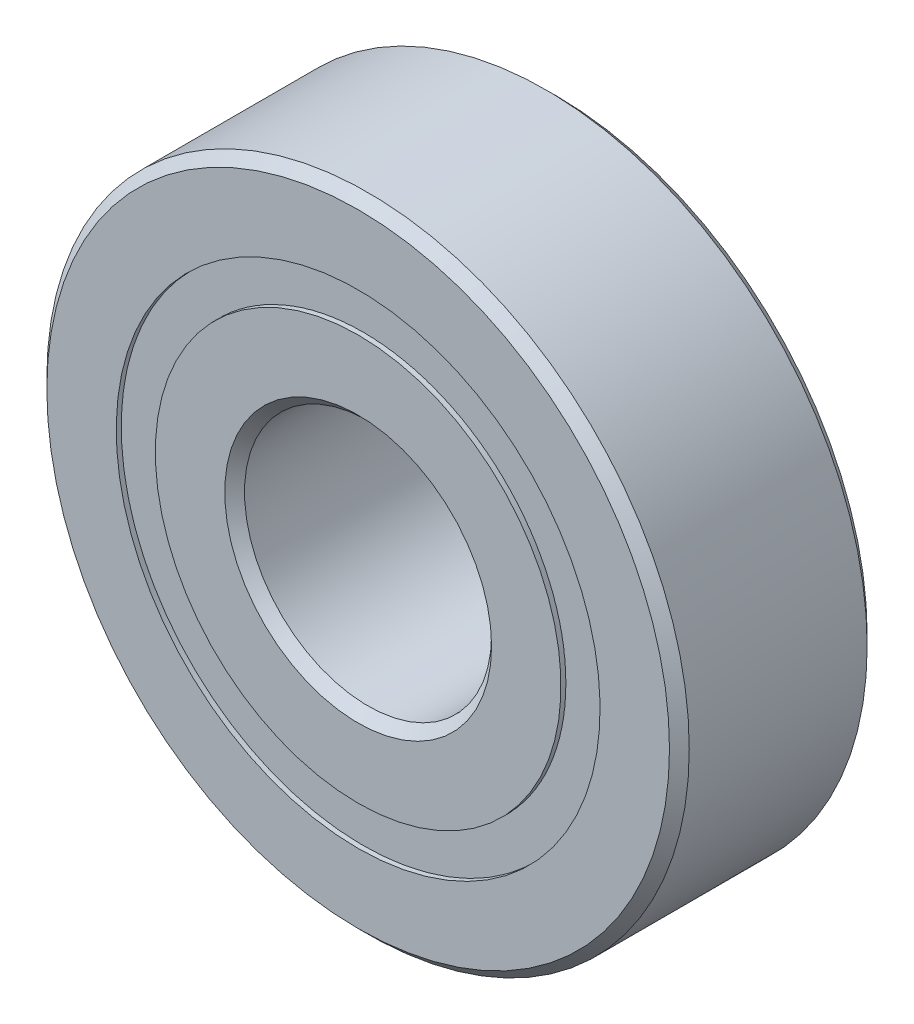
ISO-10303-21;
HEADER;
FILE_DESCRIPTION(('STEP AP214'),'2;1');
FILE_NAME('part.step','',(''),(''),'','','');
FILE_SCHEMA(('AUTOMOTIVE_DESIGN { 1 0 10303 214 1 1 1 1 }'));
ENDSEC;
DATA;
#1=APPLICATION_CONTEXT('core data for automotive mechanical design processes');
#2=APPLICATION_PROTOCOL_DEFINITION('international standard','automotive_design',2000,#1);
#3=PRODUCT_CONTEXT('',#1,'mechanical');
#4=PRODUCT('Part','Part','',(#3));
#5=PRODUCT_RELATED_PRODUCT_CATEGORY('part','',(#4));
#6=PRODUCT_DEFINITION_FORMATION('','',#4);
#7=PRODUCT_DEFINITION_CONTEXT('part definition',#1,'design');
#8=PRODUCT_DEFINITION('design','',#6,#7);
#9=PRODUCT_DEFINITION_SHAPE('','',#8);
#10=(LENGTH_UNIT() NAMED_UNIT(*) SI_UNIT(.MILLI.,.METRE.));
#11=(NAMED_UNIT(*) PLANE_ANGLE_UNIT() SI_UNIT($,.RADIAN.));
#12=(NAMED_UNIT(*) SI_UNIT($,.STERADIAN.) SOLID_ANGLE_UNIT());
#13=UNCERTAINTY_MEASURE_WITH_UNIT(LENGTH_MEASURE(1.E-05),#10,'distance_accuracy_value','');
#14=(GEOMETRIC_REPRESENTATION_CONTEXT(3) GLOBAL_UNCERTAINTY_ASSIGNED_CONTEXT((#13)) GLOBAL_UNIT_ASSIGNED_CONTEXT((#10,
#11,#12)) REPRESENTATION_CONTEXT('',''));
#15=CARTESIAN_POINT('',(0.,0.,0.));
#16=DIRECTION('',(0.,0.,1.));
#17=DIRECTION('',(1.,0.,0.));
#18=AXIS2_PLACEMENT_3D('',#15,#16,#17);
#19=CARTESIAN_POINT('',(0.,9.,0.));
#20=DIRECTION('',(0.,0.,1.));
#21=DIRECTION('',(0.,-1.,0.));
#22=AXIS2_PLACEMENT_3D('',#19,#20,#21);
#23=SPHERICAL_SURFACE('',#22,1.945894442);
#24=CARTESIAN_POINT('',(0.,9.,-1.945894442));
#25=VERTEX_POINT('',#24);
#26=VERTEX_LOOP('',#25);
#27=FACE_BOUND('',#26,.T.);
#28=CARTESIAN_POINT('',(0.,9.,1.945894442));
#29=VERTEX_POINT('',#28);
#30=VERTEX_LOOP('',#29);
#31=FACE_BOUND('',#30,.T.);
#32=ADVANCED_FACE('P0_F16',(#27,#31),#23,.T.);
#33=CLOSED_SHELL('',(#32));
#34=MANIFOLD_SOLID_BREP('P0_B1',#33);
#35=CARTESIAN_POINT('',(0.,0.,-3.6));
#36=DIRECTION('',(0.,0.,1.));
#37=DIRECTION('',(1.,0.,0.));
#38=AXIS2_PLACEMENT_3D('',#35,#36,#37);
#39=CYLINDRICAL_SURFACE('',#38,5.);
#40=CARTESIAN_POINT('',(0.,0.,-3.60000000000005));
#41=DIRECTION('',(0.,0.,-1.));
#42=DIRECTION('',(-1.,0.,0.));
#43=AXIS2_PLACEMENT_3D('',#40,#41,#42);
#44=CIRCLE('',#43,5.);
#45=CARTESIAN_POINT('',(-5.,0.,-3.6));
#46=VERTEX_POINT('',#45);
#47=EDGE_CURVE('P1_E95',#46,#46,#44,.F.);
#48=ORIENTED_EDGE('',*,*,#47,.F.);
#49=EDGE_LOOP('',(#48));
#50=FACE_BOUND('',#49,.T.);
#51=CARTESIAN_POINT('',(0.,0.,3.60000000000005));
#52=DIRECTION('',(0.,0.,1.));
#53=DIRECTION('',(1.,0.,0.));
#54=AXIS2_PLACEMENT_3D('',#51,#52,#53);
#55=CIRCLE('',#54,5.);
#56=CARTESIAN_POINT('',(5.,0.,3.6));
#57=VERTEX_POINT('',#56);
#58=EDGE_CURVE('P1_E89',#57,#57,#55,.F.);
#59=ORIENTED_EDGE('',*,*,#58,.F.);
#60=EDGE_LOOP('',(#59));
#61=FACE_BOUND('',#60,.T.);
#62=ADVANCED_FACE('P1_F17',(#50,#61),#39,.F.);
#63=CARTESIAN_POINT('',(0.,0.,-3.6));
#64=DIRECTION('',(0.,0.,-1.));
#65=DIRECTION('',(-1.,0.,0.));
#66=AXIS2_PLACEMENT_3D('',#63,#64,#65);
#67=CONICAL_SURFACE('',#66,5.,0.785398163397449);
#68=CARTESIAN_POINT('',(0.,0.,-4.));
#69=DIRECTION('',(0.,0.,-1.));
#70=DIRECTION('',(-1.,0.,0.));
#71=AXIS2_PLACEMENT_3D('',#68,#69,#70);
#72=CIRCLE('',#71,5.4);
#73=CARTESIAN_POINT('',(-5.4,0.,-4.));
#74=VERTEX_POINT('',#73);
#75=EDGE_CURVE('P1_E21',#74,#74,#72,.T.);
#76=ORIENTED_EDGE('',*,*,#75,.T.);
#77=EDGE_LOOP('',(#76));
#78=FACE_BOUND('',#77,.T.);
#79=ORIENTED_EDGE('',*,*,#47,.T.);
#80=EDGE_LOOP('',(#79));
#81=FACE_BOUND('',#80,.T.);
#82=ADVANCED_FACE('P1_F108',(#78,#81),#67,.F.);
#83=CARTESIAN_POINT('',(0.,0.,3.6));
#84=DIRECTION('',(0.,0.,1.));
#85=DIRECTION('',(1.,0.,0.));
#86=AXIS2_PLACEMENT_3D('',#83,#84,#85);
#87=CONICAL_SURFACE('',#86,5.,0.785398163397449);
#88=ORIENTED_EDGE('',*,*,#58,.T.);
#89=EDGE_LOOP('',(#88));
#90=FACE_BOUND('',#89,.T.);
#91=CARTESIAN_POINT('',(0.,0.,4.));
#92=DIRECTION('',(0.,0.,1.));
#93=DIRECTION('',(1.,0.,0.));
#94=AXIS2_PLACEMENT_3D('',#91,#92,#93);
#95=CIRCLE('',#94,5.4);
#96=CARTESIAN_POINT('',(5.4,0.,4.));
#97=VERTEX_POINT('',#96);
#98=EDGE_CURVE('P1_E101',#97,#97,#95,.T.);
#99=ORIENTED_EDGE('',*,*,#98,.T.);
#100=EDGE_LOOP('',(#99));
#101=FACE_BOUND('',#100,.T.);
#102=ADVANCED_FACE('P1_F114',(#90,#101),#87,.F.);
#103=CARTESIAN_POINT('',(-8.307296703,-8.307296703,-4.));
#104=DIRECTION('',(0.,0.,1.));
#105=DIRECTION('',(1.,0.,0.));
#106=AXIS2_PLACEMENT_3D('',#103,#104,#105);
#107=PLANE('',#106);
#108=ORIENTED_EDGE('',*,*,#75,.F.);
#109=EDGE_LOOP('',(#108));
#110=FACE_BOUND('',#109,.T.);
#111=CARTESIAN_POINT('',(0.,0.,-4.));
#112=DIRECTION('',(0.,0.,1.));
#113=DIRECTION('',(1.,0.,0.));
#114=AXIS2_PLACEMENT_3D('',#111,#112,#113);
#115=CIRCLE('',#114,8.208791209);
#116=CARTESIAN_POINT('',(8.208791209,0.,-4.));
#117=VERTEX_POINT('',#116);
#118=EDGE_CURVE('P1_E60',#117,#117,#115,.F.);
#119=ORIENTED_EDGE('',*,*,#118,.T.);
#120=EDGE_LOOP('',(#119));
#121=FACE_BOUND('',#120,.T.);
#122=ADVANCED_FACE('P1_F111',(#110,#121),#107,.F.);
#123=CARTESIAN_POINT('',(8.307296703,-8.307296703,4.));
#124=DIRECTION('',(0.,0.,-1.));
#125=DIRECTION('',(-1.,0.,0.));
#126=AXIS2_PLACEMENT_3D('',#123,#124,#125);
#127=PLANE('',#126);
#128=ORIENTED_EDGE('',*,*,#98,.F.);
#129=EDGE_LOOP('',(#128));
#130=FACE_BOUND('',#129,.T.);
#131=CARTESIAN_POINT('',(0.,0.,4.));
#132=DIRECTION('',(0.,0.,1.));
#133=DIRECTION('',(0.,-1.,0.));
#134=AXIS2_PLACEMENT_3D('',#131,#132,#133);
#135=CIRCLE('',#134,8.208791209);
#136=CARTESIAN_POINT('',(0.,-8.208791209,4.));
#137=VERTEX_POINT('',#136);
#138=EDGE_CURVE('P1_E59',#137,#137,#135,.T.);
#139=ORIENTED_EDGE('',*,*,#138,.T.);
#140=EDGE_LOOP('',(#139));
#141=FACE_BOUND('',#140,.T.);
#142=ADVANCED_FACE('P1_F19',(#130,#141),#127,.F.);
#143=CARTESIAN_POINT('',(0.,0.,-4.));
#144=DIRECTION('',(0.,0.,1.));
#145=DIRECTION('',(1.,0.,0.));
#146=AXIS2_PLACEMENT_3D('',#143,#144,#145);
#147=CYLINDRICAL_SURFACE('',#146,8.208791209);
#148=CARTESIAN_POINT('',(0.,0.,-1.7777777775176));
#149=DIRECTION('',(0.,0.,-1.));
#150=DIRECTION('',(0.,1.,0.));
#151=AXIS2_PLACEMENT_3D('',#148,#149,#150);
#152=CIRCLE('',#151,8.20879120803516);
#153=CARTESIAN_POINT('',(-8.208791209,-3.36730244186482E-09,-1.7777777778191));
#154=VERTEX_POINT('',#153);
#155=CARTESIAN_POINT('',(8.20879120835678,-4.91398098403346E-10,-1.7777777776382));
#156=VERTEX_POINT('',#155);
#157=EDGE_CURVE('P1_E65',#154,#156,#152,.T.);
#158=ORIENTED_EDGE('',*,*,#157,.T.);
#159=CARTESIAN_POINT('',(0.,0.,-1.7777777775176));
#160=DIRECTION('',(0.,0.,-1.));
#161=DIRECTION('',(0.,1.,0.));
#162=AXIS2_PLACEMENT_3D('',#159,#160,#161);
#163=CIRCLE('',#162,8.20879120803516);
#164=EDGE_CURVE('P1_E50',#156,#154,#163,.T.);
#165=ORIENTED_EDGE('',*,*,#164,.T.);
#166=EDGE_LOOP('',(#158,#165));
#167=FACE_BOUND('',#166,.T.);
#168=ORIENTED_EDGE('',*,*,#118,.F.);
#169=EDGE_LOOP('',(#168));
#170=FACE_BOUND('',#169,.T.);
#171=ADVANCED_FACE('P1_F69',(#167,#170),#147,.T.);
#172=CARTESIAN_POINT('',(-8.390225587,0.,-1.847885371));
#173=CARTESIAN_POINT('',(-8.390225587,-16.780451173,-1.847885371));
#174=CARTESIAN_POINT('',(8.390225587,-16.780451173,-1.847885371));
#175=CARTESIAN_POINT('',(8.390225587,0.,-1.847885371));
#176=CARTESIAN_POINT('',(-7.486968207,0.,-1.549824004));
#177=CARTESIAN_POINT('',(-7.486968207,-14.973936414,-1.549824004));
#178=CARTESIAN_POINT('',(7.486968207,-14.973936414,-1.549824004));
#179=CARTESIAN_POINT('',(7.486968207,0.,-1.549824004));
#180=CARTESIAN_POINT('',(-6.968868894,0.,-0.752147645));
#181=CARTESIAN_POINT('',(-6.968868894,-13.937737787,-0.752147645));
#182=CARTESIAN_POINT('',(6.968868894,-13.937737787,-0.752147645));
#183=CARTESIAN_POINT('',(6.968868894,0.,-0.752147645));
#184=CARTESIAN_POINT('',(-7.063826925,0.,0.194265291));
#185=CARTESIAN_POINT('',(-7.063826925,-14.127653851,0.194265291));
#186=CARTESIAN_POINT('',(7.063826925,-14.127653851,0.194265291));
#187=CARTESIAN_POINT('',(7.063826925,0.,0.194265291));
#188=(BOUNDED_SURFACE() B_SPLINE_SURFACE(3,3,((#172,#173,#174,#175),(#176,#177,#178,#179),(#180,
#181,#182,#183),(#184,#185,#186,#187)),.UNSPECIFIED.,.F.,.F.,
.F.) B_SPLINE_SURFACE_WITH_KNOTS((4,4),(4,4),(0.,1.),(0.,1.),
.UNSPECIFIED.) GEOMETRIC_REPRESENTATION_ITEM() RATIONAL_B_SPLINE_SURFACE(((1.,0.333333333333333,
0.333333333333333,1.),(0.853374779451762,0.284458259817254,0.284458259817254,0.853374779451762),
(0.853374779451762,0.284458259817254,0.284458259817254,0.853374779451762),(1.,0.333333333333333,
0.333333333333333,1.))) REPRESENTATION_ITEM('') SURFACE());
#189=CARTESIAN_POINT('',(-8.390225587,0.,-1.847885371));
#190=CARTESIAN_POINT('',(-7.486968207,0.,-1.549824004));
#191=CARTESIAN_POINT('',(-6.968868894,0.,-0.752147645));
#192=CARTESIAN_POINT('',(-7.063826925,0.,0.194265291));
#193=(BOUNDED_CURVE() B_SPLINE_CURVE(3,(#189,#190,#191,#192),.UNSPECIFIED.,.F.,
.F.) B_SPLINE_CURVE_WITH_KNOTS((4,4),(0.,1.),
.UNSPECIFIED.) CURVE() GEOMETRIC_REPRESENTATION_ITEM() RATIONAL_B_SPLINE_CURVE((1.,
0.853374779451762,0.853374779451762,1.)) REPRESENTATION_ITEM(''));
#194=CARTESIAN_POINT('',(-7.05410555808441,0.,-1.774671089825E-10));
#195=VERTEX_POINT('',#194);
#196=EDGE_CURVE('P1_E58',#195,#154,#193,.F.);
#197=CARTESIAN_POINT('',(8.390225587,0.,-1.847885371));
#198=CARTESIAN_POINT('',(7.486968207,0.,-1.549824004));
#199=CARTESIAN_POINT('',(6.968868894,0.,-0.752147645));
#200=CARTESIAN_POINT('',(7.063826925,0.,0.194265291));
#201=(BOUNDED_CURVE() B_SPLINE_CURVE(3,(#197,#198,#199,#200),.UNSPECIFIED.,.F.,
.F.) B_SPLINE_CURVE_WITH_KNOTS((4,4),(0.,1.),
.UNSPECIFIED.) CURVE() GEOMETRIC_REPRESENTATION_ITEM() RATIONAL_B_SPLINE_CURVE((1.,
0.853374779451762,0.853374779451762,1.)) REPRESENTATION_ITEM(''));
#202=CARTESIAN_POINT('',(7.05410555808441,0.,-3.54934244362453E-10));
#203=VERTEX_POINT('',#202);
#204=EDGE_CURVE('P1_E56',#156,#203,#201,.T.);
#205=CARTESIAN_POINT('',(0.,0.,7.09868569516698E-10));
#206=DIRECTION('',(0.,0.,-1.));
#207=DIRECTION('',(0.,1.,0.));
#208=AXIS2_PLACEMENT_3D('',#205,#206,#207);
#209=CIRCLE('',#208,7.05410555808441);
#210=EDGE_CURVE('P1_E35',#203,#195,#209,.T.);
#211=ORIENTED_EDGE('',*,*,#196,.T.);
#212=ORIENTED_EDGE('',*,*,#164,.F.);
#213=ORIENTED_EDGE('',*,*,#204,.T.);
#214=ORIENTED_EDGE('',*,*,#210,.T.);
#215=EDGE_LOOP('',(#211,#212,#213,#214));
#216=FACE_BOUND('',#215,.T.);
#217=ADVANCED_FACE('P1_F55',(#216),#188,.F.);
#218=CARTESIAN_POINT('',(0.,0.,1.777777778));
#219=DIRECTION('',(0.,0.,1.));
#220=DIRECTION('',(0.,-1.,0.));
#221=AXIS2_PLACEMENT_3D('',#218,#219,#220);
#222=CYLINDRICAL_SURFACE('',#221,8.208791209);
#223=ORIENTED_EDGE('',*,*,#138,.F.);
#224=EDGE_LOOP('',(#223));
#225=FACE_BOUND('',#224,.T.);
#226=CARTESIAN_POINT('',(0.,0.,1.7777777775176));
#227=DIRECTION('',(0.,0.,1.));
#228=DIRECTION('',(0.,-1.,0.));
#229=AXIS2_PLACEMENT_3D('',#226,#227,#228);
#230=CIRCLE('',#229,8.20879120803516);
#231=CARTESIAN_POINT('',(8.208791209,0.,1.7777777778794));
#232=VERTEX_POINT('',#231);
#233=CARTESIAN_POINT('',(-8.20879120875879,-2.52547683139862E-09,1.7777777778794));
#234=VERTEX_POINT('',#233);
#235=EDGE_CURVE('P1_E175',#232,#234,#230,.T.);
#236=ORIENTED_EDGE('',*,*,#235,.T.);
#237=CARTESIAN_POINT('',(0.,0.,1.7777777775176));
#238=DIRECTION('',(0.,0.,1.));
#239=DIRECTION('',(0.,-1.,0.));
#240=AXIS2_PLACEMENT_3D('',#237,#238,#239);
#241=CIRCLE('',#240,8.20879120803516);
#242=EDGE_CURVE('P1_E67',#234,#232,#241,.T.);
#243=ORIENTED_EDGE('',*,*,#242,.T.);
#244=EDGE_LOOP('',(#236,#243));
#245=FACE_BOUND('',#244,.T.);
#246=ADVANCED_FACE('P1_F123',(#225,#245),#222,.T.);
#247=CARTESIAN_POINT('',(8.390225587,0.,-1.847885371));
#248=CARTESIAN_POINT('',(8.390225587,16.780451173,-1.847885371));
#249=CARTESIAN_POINT('',(-8.390225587,16.780451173,-1.847885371));
#250=CARTESIAN_POINT('',(-8.390225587,0.,-1.847885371));
#251=CARTESIAN_POINT('',(7.486968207,0.,-1.549824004));
#252=CARTESIAN_POINT('',(7.486968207,14.973936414,-1.549824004));
#253=CARTESIAN_POINT('',(-7.486968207,14.973936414,-1.549824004));
#254=CARTESIAN_POINT('',(-7.486968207,0.,-1.549824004));
#255=CARTESIAN_POINT('',(6.968868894,0.,-0.752147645));
#256=CARTESIAN_POINT('',(6.968868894,13.937737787,-0.752147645));
#257=CARTESIAN_POINT('',(-6.968868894,13.937737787,-0.752147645));
#258=CARTESIAN_POINT('',(-6.968868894,0.,-0.752147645));
#259=CARTESIAN_POINT('',(7.063826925,0.,0.194265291));
#260=CARTESIAN_POINT('',(7.063826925,14.127653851,0.194265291));
#261=CARTESIAN_POINT('',(-7.063826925,14.127653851,0.194265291));
#262=CARTESIAN_POINT('',(-7.063826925,0.,0.194265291));
#263=(BOUNDED_SURFACE() B_SPLINE_SURFACE(3,3,((#247,#248,#249,#250),(#251,#252,#253,#254),(#255,
#256,#257,#258),(#259,#260,#261,#262)),.UNSPECIFIED.,.F.,.F.,
.F.) B_SPLINE_SURFACE_WITH_KNOTS((4,4),(4,4),(0.,1.),(0.,1.),
.UNSPECIFIED.) GEOMETRIC_REPRESENTATION_ITEM() RATIONAL_B_SPLINE_SURFACE(((1.,0.333333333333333,
0.333333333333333,1.),(0.853374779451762,0.284458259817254,0.284458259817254,0.853374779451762),
(0.853374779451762,0.284458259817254,0.284458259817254,0.853374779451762),(1.,0.333333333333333,
0.333333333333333,1.))) REPRESENTATION_ITEM('') SURFACE());
#264=CARTESIAN_POINT('',(0.,0.,7.09868569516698E-10));
#265=DIRECTION('',(0.,0.,-1.));
#266=DIRECTION('',(0.,1.,0.));
#267=AXIS2_PLACEMENT_3D('',#264,#265,#266);
#268=CIRCLE('',#267,7.05410555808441);
#269=EDGE_CURVE('P1_E27',#195,#203,#268,.T.);
#270=ORIENTED_EDGE('',*,*,#204,.F.);
#271=ORIENTED_EDGE('',*,*,#157,.F.);
#272=ORIENTED_EDGE('',*,*,#196,.F.);
#273=ORIENTED_EDGE('',*,*,#269,.T.);
#274=EDGE_LOOP('',(#270,#271,#272,#273));
#275=FACE_BOUND('',#274,.T.);
#276=ADVANCED_FACE('P1_F64',(#275),#263,.F.);
#277=CARTESIAN_POINT('',(-7.063826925,0.,-0.194265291));
#278=CARTESIAN_POINT('',(-7.063826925,-14.127653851,-0.194265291));
#279=CARTESIAN_POINT('',(7.063826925,-14.127653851,-0.194265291));
#280=CARTESIAN_POINT('',(7.063826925,0.,-0.194265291));
#281=CARTESIAN_POINT('',(-6.968868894,0.,0.752147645));
#282=CARTESIAN_POINT('',(-6.968868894,-13.937737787,0.752147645));
#283=CARTESIAN_POINT('',(6.968868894,-13.937737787,0.752147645));
#284=CARTESIAN_POINT('',(6.968868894,0.,0.752147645));
#285=CARTESIAN_POINT('',(-7.486968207,0.,1.549824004));
#286=CARTESIAN_POINT('',(-7.486968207,-14.973936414,1.549824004));
#287=CARTESIAN_POINT('',(7.486968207,-14.973936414,1.549824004));
#288=CARTESIAN_POINT('',(7.486968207,0.,1.549824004));
#289=CARTESIAN_POINT('',(-8.390225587,0.,1.847885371));
#290=CARTESIAN_POINT('',(-8.390225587,-16.780451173,1.847885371));
#291=CARTESIAN_POINT('',(8.390225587,-16.780451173,1.847885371));
#292=CARTESIAN_POINT('',(8.390225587,0.,1.847885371));
#293=(BOUNDED_SURFACE() B_SPLINE_SURFACE(3,3,((#277,#278,#279,#280),(#281,#282,#283,#284),(#285,
#286,#287,#288),(#289,#290,#291,#292)),.UNSPECIFIED.,.F.,.F.,
.F.) B_SPLINE_SURFACE_WITH_KNOTS((4,4),(4,4),(0.,1.),(0.,1.),
.UNSPECIFIED.) GEOMETRIC_REPRESENTATION_ITEM() RATIONAL_B_SPLINE_SURFACE(((1.,0.333333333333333,
0.333333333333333,1.),(0.853374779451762,0.284458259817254,0.284458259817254,0.853374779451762),
(0.853374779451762,0.284458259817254,0.284458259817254,0.853374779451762),(1.,0.333333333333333,
0.333333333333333,1.))) REPRESENTATION_ITEM('') SURFACE());
#294=CARTESIAN_POINT('',(7.063826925,0.,-0.194265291));
#295=CARTESIAN_POINT('',(6.968868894,0.,0.752147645));
#296=CARTESIAN_POINT('',(7.486968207,0.,1.549824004));
#297=CARTESIAN_POINT('',(8.390225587,0.,1.847885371));
#298=(BOUNDED_CURVE() B_SPLINE_CURVE(3,(#294,#295,#296,#297),.UNSPECIFIED.,.F.,
.F.) B_SPLINE_CURVE_WITH_KNOTS((4,4),(0.,1.),
.UNSPECIFIED.) CURVE() GEOMETRIC_REPRESENTATION_ITEM() RATIONAL_B_SPLINE_CURVE((1.,
0.853374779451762,0.853374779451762,1.)) REPRESENTATION_ITEM(''));
#299=EDGE_CURVE('P1_E11',#203,#232,#298,.T.);
#300=CARTESIAN_POINT('',(-7.063826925,0.,-0.194265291));
#301=CARTESIAN_POINT('',(-6.968868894,0.,0.752147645));
#302=CARTESIAN_POINT('',(-7.486968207,0.,1.549824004));
#303=CARTESIAN_POINT('',(-8.390225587,0.,1.847885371));
#304=(BOUNDED_CURVE() B_SPLINE_CURVE(3,(#300,#301,#302,#303),.UNSPECIFIED.,.F.,
.F.) B_SPLINE_CURVE_WITH_KNOTS((4,4),(0.,1.),
.UNSPECIFIED.) CURVE() GEOMETRIC_REPRESENTATION_ITEM() RATIONAL_B_SPLINE_CURVE((1.,
0.853374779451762,0.853374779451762,1.)) REPRESENTATION_ITEM(''));
#305=EDGE_CURVE('P1_E177',#234,#195,#304,.F.);
#306=ORIENTED_EDGE('',*,*,#210,.F.);
#307=ORIENTED_EDGE('',*,*,#299,.T.);
#308=ORIENTED_EDGE('',*,*,#242,.F.);
#309=ORIENTED_EDGE('',*,*,#305,.T.);
#310=EDGE_LOOP('',(#306,#307,#308,#309));
#311=FACE_BOUND('',#310,.T.);
#312=ADVANCED_FACE('P1_F129',(#311),#293,.F.);
#313=CARTESIAN_POINT('',(7.063826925,0.,-0.194265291));
#314=CARTESIAN_POINT('',(7.063826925,14.127653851,-0.194265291));
#315=CARTESIAN_POINT('',(-7.063826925,14.127653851,-0.194265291));
#316=CARTESIAN_POINT('',(-7.063826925,0.,-0.194265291));
#317=CARTESIAN_POINT('',(6.968868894,0.,0.752147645));
#318=CARTESIAN_POINT('',(6.968868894,13.937737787,0.752147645));
#319=CARTESIAN_POINT('',(-6.968868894,13.937737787,0.752147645));
#320=CARTESIAN_POINT('',(-6.968868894,0.,0.752147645));
#321=CARTESIAN_POINT('',(7.486968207,0.,1.549824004));
#322=CARTESIAN_POINT('',(7.486968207,14.973936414,1.549824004));
#323=CARTESIAN_POINT('',(-7.486968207,14.973936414,1.549824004));
#324=CARTESIAN_POINT('',(-7.486968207,0.,1.549824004));
#325=CARTESIAN_POINT('',(8.390225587,0.,1.847885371));
#326=CARTESIAN_POINT('',(8.390225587,16.780451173,1.847885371));
#327=CARTESIAN_POINT('',(-8.390225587,16.780451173,1.847885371));
#328=CARTESIAN_POINT('',(-8.390225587,0.,1.847885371));
#329=(BOUNDED_SURFACE() B_SPLINE_SURFACE(3,3,((#313,#314,#315,#316),(#317,#318,#319,#320),(#321,
#322,#323,#324),(#325,#326,#327,#328)),.UNSPECIFIED.,.F.,.F.,
.F.) B_SPLINE_SURFACE_WITH_KNOTS((4,4),(4,4),(0.,1.),(0.,1.),
.UNSPECIFIED.) GEOMETRIC_REPRESENTATION_ITEM() RATIONAL_B_SPLINE_SURFACE(((1.,0.333333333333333,
0.333333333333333,1.),(0.853374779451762,0.284458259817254,0.284458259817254,0.853374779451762),
(0.853374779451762,0.284458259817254,0.284458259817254,0.853374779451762),(1.,0.333333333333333,
0.333333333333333,1.))) REPRESENTATION_ITEM('') SURFACE());
#330=ORIENTED_EDGE('',*,*,#269,.F.);
#331=ORIENTED_EDGE('',*,*,#305,.F.);
#332=ORIENTED_EDGE('',*,*,#235,.F.);
#333=ORIENTED_EDGE('',*,*,#299,.F.);
#334=EDGE_LOOP('',(#330,#331,#332,#333));
#335=FACE_BOUND('',#334,.T.);
#336=ADVANCED_FACE('P1_F127',(#335),#329,.F.);
#337=CLOSED_SHELL('',(#62,#82,#102,#122,#142,#171,#217,#246,#276,#312,#336));
#338=MANIFOLD_SOLID_BREP('P1_B1',#337);
#339=CARTESIAN_POINT('',(0.,0.,-4.));
#340=DIRECTION('',(0.,0.,1.));
#341=DIRECTION('',(1.,0.,0.));
#342=AXIS2_PLACEMENT_3D('',#339,#340,#341);
#343=CONICAL_SURFACE('',#342,12.6,0.78539816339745);
#344=CARTESIAN_POINT('',(0.,0.,-4.));
#345=DIRECTION('',(0.,0.,1.));
#346=DIRECTION('',(1.,0.,0.));
#347=AXIS2_PLACEMENT_3D('',#344,#345,#346);
#348=CIRCLE('',#347,12.6);
#349=CARTESIAN_POINT('',(12.6,0.,-4.));
#350=VERTEX_POINT('',#349);
#351=EDGE_CURVE('P2_E21',#350,#350,#348,.T.);
#352=ORIENTED_EDGE('',*,*,#351,.T.);
#353=EDGE_LOOP('',(#352));
#354=FACE_BOUND('',#353,.T.);
#355=CARTESIAN_POINT('',(0.,0.,-3.6));
#356=DIRECTION('',(0.,0.,1.));
#357=DIRECTION('',(1.,0.,0.));
#358=AXIS2_PLACEMENT_3D('',#355,#356,#357);
#359=CIRCLE('',#358,13.);
#360=CARTESIAN_POINT('',(13.,0.,-3.6));
#361=VERTEX_POINT('',#360);
#362=EDGE_CURVE('P2_E88',#361,#361,#359,.F.);
#363=ORIENTED_EDGE('',*,*,#362,.T.);
#364=EDGE_LOOP('',(#363));
#365=FACE_BOUND('',#364,.T.);
#366=ADVANCED_FACE('P2_F17',(#354,#365),#343,.T.);
#367=CARTESIAN_POINT('',(-12.7512,-12.7512,-4.));
#368=DIRECTION('',(0.,0.,1.));
#369=DIRECTION('',(1.,0.,0.));
#370=AXIS2_PLACEMENT_3D('',#367,#368,#369);
#371=PLANE('',#370);
#372=CARTESIAN_POINT('',(0.,0.,-4.));
#373=DIRECTION('',(0.,0.,1.));
#374=DIRECTION('',(1.,0.,0.));
#375=AXIS2_PLACEMENT_3D('',#372,#373,#374);
#376=CIRCLE('',#375,9.791208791);
#377=CARTESIAN_POINT('',(9.791208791,0.,-4.));
#378=VERTEX_POINT('',#377);
#379=EDGE_CURVE('P2_E87',#378,#378,#376,.F.);
#380=ORIENTED_EDGE('',*,*,#379,.F.);
#381=EDGE_LOOP('',(#380));
#382=FACE_BOUND('',#381,.T.);
#383=ORIENTED_EDGE('',*,*,#351,.F.);
#384=EDGE_LOOP('',(#383));
#385=FACE_BOUND('',#384,.T.);
#386=ADVANCED_FACE('P2_F95',(#382,#385),#371,.F.);
#387=CARTESIAN_POINT('',(0.,0.,-3.6));
#388=DIRECTION('',(0.,0.,1.));
#389=DIRECTION('',(1.,0.,0.));
#390=AXIS2_PLACEMENT_3D('',#387,#388,#389);
#391=CYLINDRICAL_SURFACE('',#390,13.);
#392=ORIENTED_EDGE('',*,*,#362,.F.);
#393=EDGE_LOOP('',(#392));
#394=FACE_BOUND('',#393,.T.);
#395=CARTESIAN_POINT('',(0.,0.,3.60000000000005));
#396=DIRECTION('',(0.,0.,-1.));
#397=DIRECTION('',(-1.,0.,0.));
#398=AXIS2_PLACEMENT_3D('',#395,#396,#397);
#399=CIRCLE('',#398,13.);
#400=CARTESIAN_POINT('',(-13.,0.,3.6));
#401=VERTEX_POINT('',#400);
#402=EDGE_CURVE('P2_E53',#401,#401,#399,.T.);
#403=ORIENTED_EDGE('',*,*,#402,.T.);
#404=EDGE_LOOP('',(#403));
#405=FACE_BOUND('',#404,.T.);
#406=ADVANCED_FACE('P2_F98',(#394,#405),#391,.T.);
#407=CARTESIAN_POINT('',(0.,0.,-4.));
#408=DIRECTION('',(0.,0.,1.));
#409=DIRECTION('',(1.,0.,0.));
#410=AXIS2_PLACEMENT_3D('',#407,#408,#409);
#411=CYLINDRICAL_SURFACE('',#410,9.791208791);
#412=CARTESIAN_POINT('',(0.,0.,-1.77777777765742));
#413=DIRECTION('',(0.,0.,1.));
#414=DIRECTION('',(1.,0.,0.));
#415=AXIS2_PLACEMENT_3D('',#412,#413,#414);
#416=CIRCLE('',#415,9.7912087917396);
#417=CARTESIAN_POINT('',(9.7912087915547,-6.593911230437E-10,-1.77777777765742));
#418=VERTEX_POINT('',#417);
#419=CARTESIAN_POINT('',(-9.7912087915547,-1.00410524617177E-09,-1.77777777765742));
#420=VERTEX_POINT('',#419);
#421=EDGE_CURVE('P2_E45',#418,#420,#416,.T.);
#422=ORIENTED_EDGE('',*,*,#421,.T.);
#423=CARTESIAN_POINT('',(0.,0.,-1.77777777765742));
#424=DIRECTION('',(0.,0.,1.));
#425=DIRECTION('',(0.,-1.,0.));
#426=AXIS2_PLACEMENT_3D('',#423,#424,#425);
#427=CIRCLE('',#426,9.7912087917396);
#428=EDGE_CURVE('P2_E51',#420,#418,#427,.T.);
#429=ORIENTED_EDGE('',*,*,#428,.T.);
#430=EDGE_LOOP('',(#422,#429));
#431=FACE_BOUND('',#430,.T.);
#432=ORIENTED_EDGE('',*,*,#379,.T.);
#433=EDGE_LOOP('',(#432));
#434=FACE_BOUND('',#433,.T.);
#435=ADVANCED_FACE('P2_F49',(#431,#434),#411,.F.);
#436=CARTESIAN_POINT('',(0.,0.,4.));
#437=DIRECTION('',(0.,0.,-1.));
#438=DIRECTION('',(-1.,0.,0.));
#439=AXIS2_PLACEMENT_3D('',#436,#437,#438);
#440=CONICAL_SURFACE('',#439,12.6,0.78539816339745);
#441=CARTESIAN_POINT('',(0.,0.,4.));
#442=DIRECTION('',(0.,0.,-1.));
#443=DIRECTION('',(-1.,0.,0.));
#444=AXIS2_PLACEMENT_3D('',#441,#442,#443);
#445=CIRCLE('',#444,12.6);
#446=CARTESIAN_POINT('',(-12.6,0.,4.));
#447=VERTEX_POINT('',#446);
#448=EDGE_CURVE('P2_E56',#447,#447,#445,.T.);
#449=ORIENTED_EDGE('',*,*,#448,.T.);
#450=EDGE_LOOP('',(#449));
#451=FACE_BOUND('',#450,.T.);
#452=ORIENTED_EDGE('',*,*,#402,.F.);
#453=EDGE_LOOP('',(#452));
#454=FACE_BOUND('',#453,.T.);
#455=ADVANCED_FACE('P2_F112',(#451,#454),#440,.T.);
#456=CARTESIAN_POINT('',(9.609774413,0.,1.847885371));
#457=CARTESIAN_POINT('',(9.609774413,19.219548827,1.847885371));
#458=CARTESIAN_POINT('',(-9.609774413,19.219548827,1.847885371));
#459=CARTESIAN_POINT('',(-9.609774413,0.,1.847885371));
#460=CARTESIAN_POINT('',(11.767248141,0.,1.13595145));
#461=CARTESIAN_POINT('',(11.767248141,23.534496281,1.13595145));
#462=CARTESIAN_POINT('',(-11.767248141,23.534496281,1.13595145));
#463=CARTESIAN_POINT('',(-11.767248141,0.,1.13595145));
#464=CARTESIAN_POINT('',(11.767248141,0.,-1.13595145));
#465=CARTESIAN_POINT('',(11.767248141,23.534496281,-1.13595145));
#466=CARTESIAN_POINT('',(-11.767248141,23.534496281,-1.13595145));
#467=CARTESIAN_POINT('',(-11.767248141,0.,-1.13595145));
#468=CARTESIAN_POINT('',(9.609774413,0.,-1.847885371));
#469=CARTESIAN_POINT('',(9.609774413,19.219548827,-1.847885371));
#470=CARTESIAN_POINT('',(-9.609774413,19.219548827,-1.847885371));
#471=CARTESIAN_POINT('',(-9.609774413,0.,-1.847885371));
#472=(BOUNDED_SURFACE() B_SPLINE_SURFACE(3,3,((#456,#457,#458,#459),(#460,#461,#462,#463),(#464,
#465,#466,#467),(#468,#469,#470,#471)),.UNSPECIFIED.,.F.,.F.,
.F.) B_SPLINE_SURFACE_WITH_KNOTS((4,4),(4,4),(0.,1.),(0.,1.),
.UNSPECIFIED.) GEOMETRIC_REPRESENTATION_ITEM() RATIONAL_B_SPLINE_SURFACE(((1.,0.333333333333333,
0.333333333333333,1.),(0.542243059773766,0.180747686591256,0.180747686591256,0.542243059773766),
(0.542243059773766,0.180747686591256,0.180747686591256,0.542243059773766),(1.,0.333333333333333,
0.333333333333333,1.))) REPRESENTATION_ITEM('') SURFACE());
#473=CARTESIAN_POINT('',(9.609774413,0.,1.847885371));
#474=CARTESIAN_POINT('',(11.767248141,0.,1.13595145));
#475=CARTESIAN_POINT('',(11.767248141,0.,-1.13595145));
#476=CARTESIAN_POINT('',(9.609774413,0.,-1.847885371));
#477=(BOUNDED_CURVE() B_SPLINE_CURVE(3,(#473,#474,#475,#476),.UNSPECIFIED.,.F.,
.F.) B_SPLINE_CURVE_WITH_KNOTS((4,4),(0.,1.),
.UNSPECIFIED.) CURVE() GEOMETRIC_REPRESENTATION_ITEM() RATIONAL_B_SPLINE_CURVE((1.,
0.542243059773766,0.542243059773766,1.)) REPRESENTATION_ITEM(''));
#478=CARTESIAN_POINT('',(9.79120879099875,-8.79188164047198E-10,1.7777777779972));
#479=VERTEX_POINT('',#478);
#480=EDGE_CURVE('P2_E52',#418,#479,#477,.F.);
#481=CARTESIAN_POINT('',(0.,0.,1.777777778));
#482=DIRECTION('',(0.,0.,1.));
#483=DIRECTION('',(1.,0.,0.));
#484=AXIS2_PLACEMENT_3D('',#481,#482,#483);
#485=CIRCLE('',#484,9.791208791);
#486=CARTESIAN_POINT('',(-9.7912087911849,-3.01231573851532E-09,1.77777777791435));
#487=VERTEX_POINT('',#486);
#488=EDGE_CURVE('P2_E60',#487,#479,#485,.F.);
#489=CARTESIAN_POINT('',(-9.609774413,0.,1.847885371));
#490=CARTESIAN_POINT('',(-11.767248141,0.,1.13595145));
#491=CARTESIAN_POINT('',(-11.767248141,0.,-1.13595145));
#492=CARTESIAN_POINT('',(-9.609774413,0.,-1.847885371));
#493=(BOUNDED_CURVE() B_SPLINE_CURVE(3,(#489,#490,#491,#492),.UNSPECIFIED.,.F.,
.F.) B_SPLINE_CURVE_WITH_KNOTS((4,4),(0.,1.),
.UNSPECIFIED.) CURVE() GEOMETRIC_REPRESENTATION_ITEM() RATIONAL_B_SPLINE_CURVE((1.,
0.542243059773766,0.542243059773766,1.)) REPRESENTATION_ITEM(''));
#494=EDGE_CURVE('P2_E36',#487,#420,#493,.T.);
#495=ORIENTED_EDGE('',*,*,#421,.F.);
#496=ORIENTED_EDGE('',*,*,#480,.T.);
#497=ORIENTED_EDGE('',*,*,#488,.F.);
#498=ORIENTED_EDGE('',*,*,#494,.T.);
#499=EDGE_LOOP('',(#495,#496,#497,#498));
#500=FACE_BOUND('',#499,.T.);
#501=ADVANCED_FACE('P2_F59',(#500),#472,.F.);
#502=CARTESIAN_POINT('',(-9.609774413,0.,1.847885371));
#503=CARTESIAN_POINT('',(-9.609774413,-19.219548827,1.847885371));
#504=CARTESIAN_POINT('',(9.609774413,-19.219548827,1.847885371));
#505=CARTESIAN_POINT('',(9.609774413,0.,1.847885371));
#506=CARTESIAN_POINT('',(-11.767248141,0.,1.13595145));
#507=CARTESIAN_POINT('',(-11.767248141,-23.534496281,1.13595145));
#508=CARTESIAN_POINT('',(11.767248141,-23.534496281,1.13595145));
#509=CARTESIAN_POINT('',(11.767248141,0.,1.13595145));
#510=CARTESIAN_POINT('',(-11.767248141,0.,-1.13595145));
#511=CARTESIAN_POINT('',(-11.767248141,-23.534496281,-1.13595145));
#512=CARTESIAN_POINT('',(11.767248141,-23.534496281,-1.13595145));
#513=CARTESIAN_POINT('',(11.767248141,0.,-1.13595145));
#514=CARTESIAN_POINT('',(-9.609774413,0.,-1.847885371));
#515=CARTESIAN_POINT('',(-9.609774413,-19.219548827,-1.847885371));
#516=CARTESIAN_POINT('',(9.609774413,-19.219548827,-1.847885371));
#517=CARTESIAN_POINT('',(9.609774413,0.,-1.847885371));
#518=(BOUNDED_SURFACE() B_SPLINE_SURFACE(3,3,((#502,#503,#504,#505),(#506,#507,#508,#509),(#510,
#511,#512,#513),(#514,#515,#516,#517)),.UNSPECIFIED.,.F.,.F.,
.F.) B_SPLINE_SURFACE_WITH_KNOTS((4,4),(4,4),(0.,1.),(0.,1.),
.UNSPECIFIED.) GEOMETRIC_REPRESENTATION_ITEM() RATIONAL_B_SPLINE_SURFACE(((1.,0.333333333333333,
0.333333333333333,1.),(0.542243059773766,0.180747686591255,0.180747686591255,0.542243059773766),
(0.542243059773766,0.180747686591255,0.180747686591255,0.542243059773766),(1.,0.333333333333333,
0.333333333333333,1.))) REPRESENTATION_ITEM('') SURFACE());
#519=CARTESIAN_POINT('',(0.,0.,1.777777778));
#520=DIRECTION('',(0.,0.,1.));
#521=DIRECTION('',(1.,0.,0.));
#522=AXIS2_PLACEMENT_3D('',#519,#520,#521);
#523=CIRCLE('',#522,9.791208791);
#524=EDGE_CURVE('P2_E27',#479,#487,#523,.F.);
#525=ORIENTED_EDGE('',*,*,#494,.F.);
#526=ORIENTED_EDGE('',*,*,#524,.F.);
#527=ORIENTED_EDGE('',*,*,#480,.F.);
#528=ORIENTED_EDGE('',*,*,#428,.F.);
#529=EDGE_LOOP('',(#525,#526,#527,#528));
#530=FACE_BOUND('',#529,.T.);
#531=ADVANCED_FACE('P2_F55',(#530),#518,.F.);
#532=CARTESIAN_POINT('',(12.7512,-12.7512,4.));
#533=DIRECTION('',(0.,0.,-1.));
#534=DIRECTION('',(-1.,0.,0.));
#535=AXIS2_PLACEMENT_3D('',#532,#533,#534);
#536=PLANE('',#535);
#537=CARTESIAN_POINT('',(0.,0.,4.));
#538=DIRECTION('',(0.,0.,1.));
#539=DIRECTION('',(0.,-1.,0.));
#540=AXIS2_PLACEMENT_3D('',#537,#538,#539);
#541=CIRCLE('',#540,9.791208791);
#542=CARTESIAN_POINT('',(0.,-9.791208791,4.));
#543=VERTEX_POINT('',#542);
#544=EDGE_CURVE('P2_E11',#543,#543,#541,.T.);
#545=ORIENTED_EDGE('',*,*,#544,.F.);
#546=EDGE_LOOP('',(#545));
#547=FACE_BOUND('',#546,.T.);
#548=ORIENTED_EDGE('',*,*,#448,.F.);
#549=EDGE_LOOP('',(#548));
#550=FACE_BOUND('',#549,.T.);
#551=ADVANCED_FACE('P2_F19',(#547,#550),#536,.F.);
#552=CARTESIAN_POINT('',(0.,0.,1.777777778));
#553=DIRECTION('',(0.,0.,1.));
#554=DIRECTION('',(0.,-1.,0.));
#555=AXIS2_PLACEMENT_3D('',#552,#553,#554);
#556=CYLINDRICAL_SURFACE('',#555,9.791208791);
#557=ORIENTED_EDGE('',*,*,#544,.T.);
#558=EDGE_LOOP('',(#557));
#559=FACE_BOUND('',#558,.T.);
#560=ORIENTED_EDGE('',*,*,#524,.T.);
#561=ORIENTED_EDGE('',*,*,#488,.T.);
#562=EDGE_LOOP('',(#560,#561));
#563=FACE_BOUND('',#562,.T.);
#564=ADVANCED_FACE('P2_F123',(#559,#563),#556,.F.);
#565=CLOSED_SHELL('',(#366,#386,#406,#435,#455,#501,#531,#551,#564));
#566=MANIFOLD_SOLID_BREP('P2_B1',#565);
#567=CARTESIAN_POINT('',(0.,0.,-3.8));
#568=DIRECTION('',(0.,0.,1.));
#569=DIRECTION('',(0.,-1.,0.));
#570=AXIS2_PLACEMENT_3D('',#567,#568,#569);
#571=CYLINDRICAL_SURFACE('',#570,8.208791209);
#572=CARTESIAN_POINT('',(0.,0.,-3.8));
#573=DIRECTION('',(0.,0.,1.));
#574=DIRECTION('',(0.,-1.,0.));
#575=AXIS2_PLACEMENT_3D('',#572,#573,#574);
#576=CIRCLE('',#575,8.208791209);
#577=CARTESIAN_POINT('',(0.,-8.208791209,-3.8));
#578=VERTEX_POINT('',#577);
#579=EDGE_CURVE('P3_E27',#578,#578,#576,.F.);
#580=ORIENTED_EDGE('',*,*,#579,.T.);
#581=EDGE_LOOP('',(#580));
#582=FACE_BOUND('',#581,.T.);
#583=CARTESIAN_POINT('',(0.,0.,-1.945894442));
#584=DIRECTION('',(0.,0.,1.));
#585=DIRECTION('',(0.,-1.,0.));
#586=AXIS2_PLACEMENT_3D('',#583,#584,#585);
#587=CIRCLE('',#586,8.208791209);
#588=CARTESIAN_POINT('',(0.,-8.208791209,-1.945894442));
#589=VERTEX_POINT('',#588);
#590=EDGE_CURVE('P3_E18',#589,#589,#587,.T.);
#591=ORIENTED_EDGE('',*,*,#590,.T.);
#592=EDGE_LOOP('',(#591));
#593=FACE_BOUND('',#592,.T.);
#594=ADVANCED_FACE('P3_F14',(#582,#593),#571,.F.);
#595=CARTESIAN_POINT('',(9.908703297,-9.908703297,-1.945894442));
#596=DIRECTION('',(0.,0.,-1.));
#597=DIRECTION('',(-1.,0.,0.));
#598=AXIS2_PLACEMENT_3D('',#595,#596,#597);
#599=PLANE('',#598);
#600=ORIENTED_EDGE('',*,*,#590,.F.);
#601=EDGE_LOOP('',(#600));
#602=FACE_BOUND('',#601,.T.);
#603=CARTESIAN_POINT('',(0.,0.,-1.945894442));
#604=DIRECTION('',(0.,0.,1.));
#605=DIRECTION('',(0.,-1.,0.));
#606=AXIS2_PLACEMENT_3D('',#603,#604,#605);
#607=CIRCLE('',#606,9.791208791);
#608=CARTESIAN_POINT('',(0.,-9.791208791,-1.945894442));
#609=VERTEX_POINT('',#608);
#610=EDGE_CURVE('P3_E22',#609,#609,#607,.T.);
#611=ORIENTED_EDGE('',*,*,#610,.T.);
#612=EDGE_LOOP('',(#611));
#613=FACE_BOUND('',#612,.T.);
#614=ADVANCED_FACE('P3_F36',(#602,#613),#599,.F.);
#615=CARTESIAN_POINT('',(-9.908703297,-9.908703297,-3.8));
#616=DIRECTION('',(0.,0.,1.));
#617=DIRECTION('',(1.,0.,0.));
#618=AXIS2_PLACEMENT_3D('',#615,#616,#617);
#619=PLANE('',#618);
#620=ORIENTED_EDGE('',*,*,#579,.F.);
#621=EDGE_LOOP('',(#620));
#622=FACE_BOUND('',#621,.T.);
#623=CARTESIAN_POINT('',(0.,0.,-3.8));
#624=DIRECTION('',(0.,0.,1.));
#625=DIRECTION('',(0.,-1.,0.));
#626=AXIS2_PLACEMENT_3D('',#623,#624,#625);
#627=CIRCLE('',#626,9.791208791);
#628=CARTESIAN_POINT('',(0.,-9.791208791,-3.8));
#629=VERTEX_POINT('',#628);
#630=EDGE_CURVE('P3_E9',#629,#629,#627,.F.);
#631=ORIENTED_EDGE('',*,*,#630,.T.);
#632=EDGE_LOOP('',(#631));
#633=FACE_BOUND('',#632,.T.);
#634=ADVANCED_FACE('P3_F16',(#622,#633),#619,.F.);
#635=CARTESIAN_POINT('',(0.,0.,-3.8));
#636=DIRECTION('',(0.,0.,1.));
#637=DIRECTION('',(0.,-1.,0.));
#638=AXIS2_PLACEMENT_3D('',#635,#636,#637);
#639=CYLINDRICAL_SURFACE('',#638,9.791208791);
#640=ORIENTED_EDGE('',*,*,#610,.F.);
#641=EDGE_LOOP('',(#640));
#642=FACE_BOUND('',#641,.T.);
#643=ORIENTED_EDGE('',*,*,#630,.F.);
#644=EDGE_LOOP('',(#643));
#645=FACE_BOUND('',#644,.T.);
#646=ADVANCED_FACE('P3_F41',(#642,#645),#639,.T.);
#647=CLOSED_SHELL('',(#594,#614,#634,#646));
#648=MANIFOLD_SOLID_BREP('P3_B1',#647);
#649=CARTESIAN_POINT('',(0.,0.,1.945894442));
#650=DIRECTION('',(0.,0.,1.));
#651=DIRECTION('',(1.,0.,0.));
#652=AXIS2_PLACEMENT_3D('',#649,#650,#651);
#653=CYLINDRICAL_SURFACE('',#652,8.208791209);
#654=CARTESIAN_POINT('',(0.,0.,1.945894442));
#655=DIRECTION('',(0.,0.,1.));
#656=DIRECTION('',(1.,0.,0.));
#657=AXIS2_PLACEMENT_3D('',#654,#655,#656);
#658=CIRCLE('',#657,8.208791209);
#659=CARTESIAN_POINT('',(8.208791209,0.,1.945894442));
#660=VERTEX_POINT('',#659);
#661=EDGE_CURVE('P4_E28',#660,#660,#658,.F.);
#662=ORIENTED_EDGE('',*,*,#661,.T.);
#663=EDGE_LOOP('',(#662));
#664=FACE_BOUND('',#663,.T.);
#665=CARTESIAN_POINT('',(0.,0.,3.8));
#666=DIRECTION('',(0.,0.,1.));
#667=DIRECTION('',(1.,0.,0.));
#668=AXIS2_PLACEMENT_3D('',#665,#666,#667);
#669=CIRCLE('',#668,8.208791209);
#670=CARTESIAN_POINT('',(8.208791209,0.,3.8));
#671=VERTEX_POINT('',#670);
#672=EDGE_CURVE('P4_E19',#671,#671,#669,.T.);
#673=ORIENTED_EDGE('',*,*,#672,.T.);
#674=EDGE_LOOP('',(#673));
#675=FACE_BOUND('',#674,.T.);
#676=ADVANCED_FACE('P4_F15',(#664,#675),#653,.F.);
#677=CARTESIAN_POINT('',(9.908703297,-9.908703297,3.8));
#678=DIRECTION('',(0.,0.,-1.));
#679=DIRECTION('',(-1.,0.,0.));
#680=AXIS2_PLACEMENT_3D('',#677,#678,#679);
#681=PLANE('',#680);
#682=ORIENTED_EDGE('',*,*,#672,.F.);
#683=EDGE_LOOP('',(#682));
#684=FACE_BOUND('',#683,.T.);
#685=CARTESIAN_POINT('',(0.,0.,3.8));
#686=DIRECTION('',(0.,0.,1.));
#687=DIRECTION('',(1.,0.,0.));
#688=AXIS2_PLACEMENT_3D('',#685,#686,#687);
#689=CIRCLE('',#688,9.791208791);
#690=CARTESIAN_POINT('',(9.791208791,0.,3.8));
#691=VERTEX_POINT('',#690);
#692=EDGE_CURVE('P4_E23',#691,#691,#689,.T.);
#693=ORIENTED_EDGE('',*,*,#692,.T.);
#694=EDGE_LOOP('',(#693));
#695=FACE_BOUND('',#694,.T.);
#696=ADVANCED_FACE('P4_F37',(#684,#695),#681,.F.);
#697=CARTESIAN_POINT('',(-9.908703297,-9.908703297,1.945894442));
#698=DIRECTION('',(0.,0.,1.));
#699=DIRECTION('',(1.,0.,0.));
#700=AXIS2_PLACEMENT_3D('',#697,#698,#699);
#701=PLANE('',#700);
#702=ORIENTED_EDGE('',*,*,#661,.F.);
#703=EDGE_LOOP('',(#702));
#704=FACE_BOUND('',#703,.T.);
#705=CARTESIAN_POINT('',(0.,0.,1.945894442));
#706=DIRECTION('',(0.,0.,1.));
#707=DIRECTION('',(1.,0.,0.));
#708=AXIS2_PLACEMENT_3D('',#705,#706,#707);
#709=CIRCLE('',#708,9.791208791);
#710=CARTESIAN_POINT('',(9.791208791,0.,1.945894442));
#711=VERTEX_POINT('',#710);
#712=EDGE_CURVE('P4_E10',#711,#711,#709,.F.);
#713=ORIENTED_EDGE('',*,*,#712,.T.);
#714=EDGE_LOOP('',(#713));
#715=FACE_BOUND('',#714,.T.);
#716=ADVANCED_FACE('P4_F17',(#704,#715),#701,.F.);
#717=CARTESIAN_POINT('',(0.,0.,1.945894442));
#718=DIRECTION('',(0.,0.,1.));
#719=DIRECTION('',(1.,0.,0.));
#720=AXIS2_PLACEMENT_3D('',#717,#718,#719);
#721=CYLINDRICAL_SURFACE('',#720,9.791208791);
#722=ORIENTED_EDGE('',*,*,#692,.F.);
#723=EDGE_LOOP('',(#722));
#724=FACE_BOUND('',#723,.T.);
#725=ORIENTED_EDGE('',*,*,#712,.F.);
#726=EDGE_LOOP('',(#725));
#727=FACE_BOUND('',#726,.T.);
#728=ADVANCED_FACE('P4_F42',(#724,#727),#721,.T.);
#729=CLOSED_SHELL('',(#676,#696,#716,#728));
#730=MANIFOLD_SOLID_BREP('P4_B1',#729);
#731=CARTESIAN_POINT('',(0.,-9.,0.));
#732=DIRECTION('',(0.,0.,1.));
#733=DIRECTION('',(0.,1.,0.));
#734=AXIS2_PLACEMENT_3D('',#731,#732,#733);
#735=SPHERICAL_SURFACE('',#734,1.945894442);
#736=CARTESIAN_POINT('',(0.,-9.,-1.94589444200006));
#737=VERTEX_POINT('',#736);
#738=VERTEX_LOOP('',#737);
#739=FACE_BOUND('',#738,.T.);
#740=CARTESIAN_POINT('',(0.,-9.,1.94589444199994));
#741=VERTEX_POINT('',#740);
#742=VERTEX_LOOP('',#741);
#743=FACE_BOUND('',#742,.T.);
#744=ADVANCED_FACE('P5_F16',(#739,#743),#735,.T.);
#745=CLOSED_SHELL('',(#744));
#746=MANIFOLD_SOLID_BREP('P5_B1',#745);
#747=ADVANCED_BREP_SHAPE_REPRESENTATION('',(#18,#34,#338,#566,#648,#730,#746),#14);
#748=SHAPE_DEFINITION_REPRESENTATION(#9,#747);
ENDSEC;
END-ISO-10303-21;
